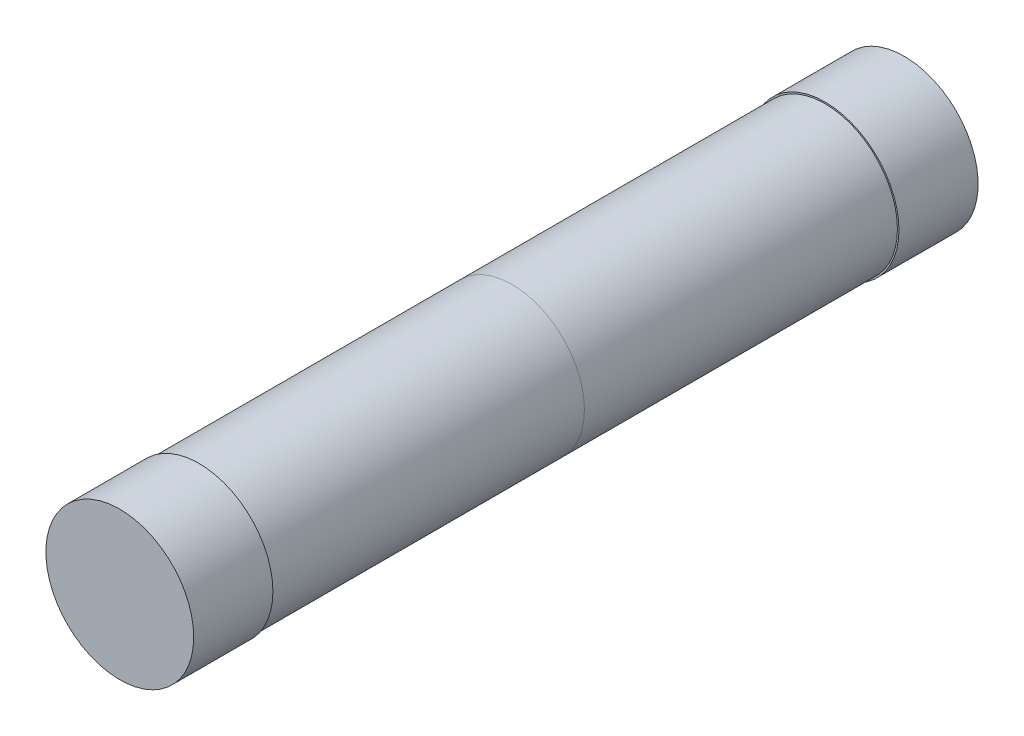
ISO-10303-21;
HEADER;
FILE_DESCRIPTION(('STEP AP214'),'2;1');
FILE_NAME('part.step','',(''),(''),'','','');
FILE_SCHEMA(('AUTOMOTIVE_DESIGN { 1 0 10303 214 1 1 1 1 }'));
ENDSEC;
DATA;
#1=APPLICATION_CONTEXT('core data for automotive mechanical design processes');
#2=APPLICATION_PROTOCOL_DEFINITION('international standard','automotive_design',2000,#1);
#3=PRODUCT_CONTEXT('',#1,'mechanical');
#4=PRODUCT('Part','Part','',(#3));
#5=PRODUCT_RELATED_PRODUCT_CATEGORY('part','',(#4));
#6=PRODUCT_DEFINITION_FORMATION('','',#4);
#7=PRODUCT_DEFINITION_CONTEXT('part definition',#1,'design');
#8=PRODUCT_DEFINITION('design','',#6,#7);
#9=PRODUCT_DEFINITION_SHAPE('','',#8);
#10=(LENGTH_UNIT() NAMED_UNIT(*) SI_UNIT(.MILLI.,.METRE.));
#11=(NAMED_UNIT(*) PLANE_ANGLE_UNIT() SI_UNIT($,.RADIAN.));
#12=(NAMED_UNIT(*) SI_UNIT($,.STERADIAN.) SOLID_ANGLE_UNIT());
#13=UNCERTAINTY_MEASURE_WITH_UNIT(LENGTH_MEASURE(1.E-05),#10,'distance_accuracy_value','');
#14=(GEOMETRIC_REPRESENTATION_CONTEXT(3) GLOBAL_UNCERTAINTY_ASSIGNED_CONTEXT((#13)) GLOBAL_UNIT_ASSIGNED_CONTEXT((#10,
#11,#12)) REPRESENTATION_CONTEXT('',''));
#15=CARTESIAN_POINT('',(0.,0.,0.));
#16=DIRECTION('',(0.,0.,1.));
#17=DIRECTION('',(1.,0.,0.));
#18=AXIS2_PLACEMENT_3D('',#15,#16,#17);
#19=CARTESIAN_POINT('',(9.69843126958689,-11.236668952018,-2.81415839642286));
#20=DIRECTION('',(0.,0.,1.));
#21=DIRECTION('',(1.,0.,0.));
#22=AXIS2_PLACEMENT_3D('',#19,#20,#21);
#23=CYLINDRICAL_SURFACE('',#22,0.960000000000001);
#24=CARTESIAN_POINT('',(9.69843126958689,-11.236668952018,5.48584160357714));
#25=DIRECTION('',(0.,0.,1.));
#26=DIRECTION('',(1.,0.,0.));
#27=AXIS2_PLACEMENT_3D('',#24,#25,#26);
#28=CIRCLE('',#27,0.960000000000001);
#29=CARTESIAN_POINT('',(10.6584312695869,-11.236668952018,5.48584160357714));
#30=VERTEX_POINT('',#29);
#31=EDGE_CURVE('E57',#30,#30,#28,.T.);
#32=CARTESIAN_POINT('',(9.69843126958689,-11.236668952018,1.33584160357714));
#33=DIRECTION('',(0.,0.,-1.));
#34=DIRECTION('',(-1.,0.,0.));
#35=AXIS2_PLACEMENT_3D('',#32,#33,#34);
#36=CIRCLE('',#35,0.960000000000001);
#37=CARTESIAN_POINT('',(10.6584312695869,-11.236668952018,1.33584160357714));
#38=VERTEX_POINT('',#37);
#39=EDGE_CURVE('E11',#38,#38,#36,.F.);
#40=CARTESIAN_POINT('',(10.6584312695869,-11.236668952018,5.48584160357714));
#41=CARTESIAN_POINT('',(10.6584312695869,-11.236668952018,5.44261243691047));
#42=CARTESIAN_POINT('',(10.6584312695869,-11.236668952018,5.3993832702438));
#43=CARTESIAN_POINT('',(10.6584312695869,-11.236668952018,5.31292493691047));
#44=CARTESIAN_POINT('',(10.6584312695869,-11.236668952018,5.26969577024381));
#45=CARTESIAN_POINT('',(10.6584312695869,-11.236668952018,5.18323743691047));
#46=CARTESIAN_POINT('',(10.6584312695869,-11.236668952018,5.1400082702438));
#47=CARTESIAN_POINT('',(10.6584312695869,-11.236668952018,5.05354993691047));
#48=CARTESIAN_POINT('',(10.6584312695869,-11.236668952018,5.0103207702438));
#49=CARTESIAN_POINT('',(10.6584312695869,-11.236668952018,4.92386243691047));
#50=CARTESIAN_POINT('',(10.6584312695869,-11.236668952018,4.88063327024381));
#51=CARTESIAN_POINT('',(10.6584312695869,-11.236668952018,4.79417493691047));
#52=CARTESIAN_POINT('',(10.6584312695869,-11.236668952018,4.75094577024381));
#53=CARTESIAN_POINT('',(10.6584312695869,-11.236668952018,4.66448743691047));
#54=CARTESIAN_POINT('',(10.6584312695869,-11.236668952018,4.62125827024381));
#55=CARTESIAN_POINT('',(10.6584312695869,-11.236668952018,4.53479993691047));
#56=CARTESIAN_POINT('',(10.6584312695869,-11.236668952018,4.49157077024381));
#57=CARTESIAN_POINT('',(10.6584312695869,-11.236668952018,4.40511243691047));
#58=CARTESIAN_POINT('',(10.6584312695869,-11.236668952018,4.3618832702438));
#59=CARTESIAN_POINT('',(10.6584312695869,-11.236668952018,4.27542493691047));
#60=CARTESIAN_POINT('',(10.6584312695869,-11.236668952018,4.23219577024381));
#61=CARTESIAN_POINT('',(10.6584312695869,-11.236668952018,4.14573743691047));
#62=CARTESIAN_POINT('',(10.6584312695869,-11.236668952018,4.10250827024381));
#63=CARTESIAN_POINT('',(10.6584312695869,-11.236668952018,4.01604993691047));
#64=CARTESIAN_POINT('',(10.6584312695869,-11.236668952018,3.9728207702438));
#65=CARTESIAN_POINT('',(10.6584312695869,-11.236668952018,3.88636243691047));
#66=CARTESIAN_POINT('',(10.6584312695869,-11.236668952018,3.84313327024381));
#67=CARTESIAN_POINT('',(10.6584312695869,-11.236668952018,3.75667493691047));
#68=CARTESIAN_POINT('',(10.6584312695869,-11.236668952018,3.7134457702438));
#69=CARTESIAN_POINT('',(10.6584312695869,-11.236668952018,3.62698743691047));
#70=CARTESIAN_POINT('',(10.6584312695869,-11.236668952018,3.5837582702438));
#71=CARTESIAN_POINT('',(10.6584312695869,-11.236668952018,3.49729993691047));
#72=CARTESIAN_POINT('',(10.6584312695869,-11.236668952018,3.4540707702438));
#73=CARTESIAN_POINT('',(10.6584312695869,-11.236668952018,3.36761243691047));
#74=CARTESIAN_POINT('',(10.6584312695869,-11.236668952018,3.32438327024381));
#75=CARTESIAN_POINT('',(10.6584312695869,-11.236668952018,3.23792493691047));
#76=CARTESIAN_POINT('',(10.6584312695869,-11.236668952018,3.19469577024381));
#77=CARTESIAN_POINT('',(10.6584312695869,-11.236668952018,3.10823743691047));
#78=CARTESIAN_POINT('',(10.6584312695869,-11.236668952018,3.0650082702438));
#79=CARTESIAN_POINT('',(10.6584312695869,-11.236668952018,2.97854993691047));
#80=CARTESIAN_POINT('',(10.6584312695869,-11.236668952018,2.9353207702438));
#81=CARTESIAN_POINT('',(10.6584312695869,-11.236668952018,2.84886243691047));
#82=CARTESIAN_POINT('',(10.6584312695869,-11.236668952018,2.80563327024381));
#83=CARTESIAN_POINT('',(10.6584312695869,-11.236668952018,2.71917493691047));
#84=CARTESIAN_POINT('',(10.6584312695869,-11.236668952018,2.6759457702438));
#85=CARTESIAN_POINT('',(10.6584312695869,-11.236668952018,2.58948743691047));
#86=CARTESIAN_POINT('',(10.6584312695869,-11.236668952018,2.5462582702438));
#87=CARTESIAN_POINT('',(10.6584312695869,-11.236668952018,2.45979993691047));
#88=CARTESIAN_POINT('',(10.6584312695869,-11.236668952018,2.4165707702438));
#89=CARTESIAN_POINT('',(10.6584312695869,-11.236668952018,2.33011243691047));
#90=CARTESIAN_POINT('',(10.6584312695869,-11.236668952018,2.28688327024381));
#91=CARTESIAN_POINT('',(10.6584312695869,-11.236668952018,2.20042493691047));
#92=CARTESIAN_POINT('',(10.6584312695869,-11.236668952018,2.1571957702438));
#93=CARTESIAN_POINT('',(10.6584312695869,-11.236668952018,2.07073743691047));
#94=CARTESIAN_POINT('',(10.6584312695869,-11.236668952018,2.0275082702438));
#95=CARTESIAN_POINT('',(10.6584312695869,-11.236668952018,1.94104993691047));
#96=CARTESIAN_POINT('',(10.6584312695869,-11.236668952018,1.8978207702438));
#97=CARTESIAN_POINT('',(10.6584312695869,-11.236668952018,1.81136243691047));
#98=CARTESIAN_POINT('',(10.6584312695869,-11.236668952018,1.7681332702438));
#99=CARTESIAN_POINT('',(10.6584312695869,-11.236668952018,1.68167493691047));
#100=CARTESIAN_POINT('',(10.6584312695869,-11.236668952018,1.6384457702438));
#101=CARTESIAN_POINT('',(10.6584312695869,-11.236668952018,1.55198743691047));
#102=CARTESIAN_POINT('',(10.6584312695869,-11.236668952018,1.5087582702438));
#103=CARTESIAN_POINT('',(10.6584312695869,-11.236668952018,1.42229993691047));
#104=CARTESIAN_POINT('',(10.6584312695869,-11.236668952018,1.3790707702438));
#105=CARTESIAN_POINT('',(10.6584312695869,-11.236668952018,1.33584160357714));
#106=B_SPLINE_CURVE_WITH_KNOTS('',3,(#40,#41,#42,#43,#44,#45,#46,#47,#48,#49,#50,#51,#52,#53,
#54,#55,#56,#57,#58,#59,#60,#61,#62,#63,#64,#65,#66,#67,#68,#69,#70,#71,#72,#73,#74,#75,#76,#77,
#78,#79,#80,#81,#82,#83,#84,#85,#86,#87,#88,#89,#90,#91,#92,#93,#94,#95,#96,#97,#98,#99,#100,
#101,#102,#103,#104,#105),.UNSPECIFIED.,.F.,.F.,(4,2,2,2,2,2,2,2,2,2,2,2,2,2,2,2,2,2,2,2,2,2,2,
2,2,2,2,2,2,2,2,2,4),(0.,0.1296875,0.259374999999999,0.389062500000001,0.518749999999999,
0.648437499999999,0.778124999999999,0.9078125,1.0375,1.1671875,1.296875,1.4265625,1.55625,
1.6859375,1.815625,1.9453125,2.075,2.2046875,2.334375,2.4640625,2.59375,2.7234375,2.853125,
2.9828125,3.1125,3.2421875,3.371875,3.5015625,3.63125,3.7609375,3.890625,4.0203125,4.15),.UNSPECIFIED.);
#107=EDGE_CURVE('BSEAM35',#30,#38,#106,.T.);
#108=ORIENTED_EDGE('',*,*,#31,.F.);
#109=ORIENTED_EDGE('',*,*,#39,.T.);
#110=ORIENTED_EDGE('',*,*,#107,.T.);
#111=ORIENTED_EDGE('',*,*,#107,.F.);
#112=EDGE_LOOP('',(#108,#110,#109,#111));
#113=FACE_BOUND('',#112,.T.);
#114=ADVANCED_FACE('F35',(#113),#23,.T.);
#115=CARTESIAN_POINT('',(10.7274311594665,-10.207669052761,-3.86415839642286));
#116=DIRECTION('',(0.,0.,-1.));
#117=DIRECTION('',(0.,-1.,0.));
#118=AXIS2_PLACEMENT_3D('',#115,#116,#117);
#119=PLANE('',#118);
#120=CARTESIAN_POINT('',(9.69843126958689,-11.236668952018,-3.86415839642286));
#121=DIRECTION('',(0.,0.,-1.));
#122=DIRECTION('',(-1.,0.,0.));
#123=AXIS2_PLACEMENT_3D('',#120,#121,#122);
#124=CIRCLE('',#123,0.979999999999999);
#125=CARTESIAN_POINT('',(8.71843126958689,-11.236668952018,-3.86415839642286));
#126=VERTEX_POINT('',#125);
#127=EDGE_CURVE('E43',#126,#126,#124,.F.);
#128=ORIENTED_EDGE('',*,*,#127,.F.);
#129=EDGE_LOOP('',(#128));
#130=FACE_BOUND('',#129,.T.);
#131=ADVANCED_FACE('F86',(#130),#119,.T.);
#132=CARTESIAN_POINT('',(9.69843126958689,-11.236668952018,-1.66415839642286));
#133=DIRECTION('',(0.,0.,-1.));
#134=DIRECTION('',(-1.,0.,0.));
#135=AXIS2_PLACEMENT_3D('',#132,#133,#134);
#136=CYLINDRICAL_SURFACE('',#135,0.979999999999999);
#137=ORIENTED_EDGE('',*,*,#127,.T.);
#138=EDGE_LOOP('',(#137));
#139=FACE_BOUND('',#138,.T.);
#140=CARTESIAN_POINT('',(9.69843126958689,-11.236668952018,-2.81415839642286));
#141=DIRECTION('',(0.,0.,1.));
#142=DIRECTION('',(1.,0.,0.));
#143=AXIS2_PLACEMENT_3D('',#140,#141,#142);
#144=CIRCLE('',#143,0.979999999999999);
#145=CARTESIAN_POINT('',(10.6784312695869,-11.236668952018,-2.81415839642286));
#146=VERTEX_POINT('',#145);
#147=EDGE_CURVE('E60',#146,#146,#144,.F.);
#148=ORIENTED_EDGE('',*,*,#147,.T.);
#149=EDGE_LOOP('',(#148));
#150=FACE_BOUND('',#149,.T.);
#151=ADVANCED_FACE('F37',(#139,#150),#136,.T.);
#152=CARTESIAN_POINT('',(9.69843126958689,-11.236668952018,-2.81415839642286));
#153=DIRECTION('',(0.,0.,1.));
#154=DIRECTION('',(1.,0.,0.));
#155=AXIS2_PLACEMENT_3D('',#152,#153,#154);
#156=PLANE('',#155);
#157=ORIENTED_EDGE('',*,*,#147,.F.);
#158=EDGE_LOOP('',(#157));
#159=FACE_BOUND('',#158,.T.);
#160=CARTESIAN_POINT('',(9.69843126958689,-11.236668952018,-2.81415839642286));
#161=DIRECTION('',(0.,0.,1.));
#162=DIRECTION('',(1.,0.,0.));
#163=AXIS2_PLACEMENT_3D('',#160,#161,#162);
#164=CIRCLE('',#163,0.960000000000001);
#165=CARTESIAN_POINT('',(10.6584312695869,-11.236668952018,-2.81415839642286));
#166=VERTEX_POINT('',#165);
#167=EDGE_CURVE('E62',#166,#166,#164,.T.);
#168=ORIENTED_EDGE('',*,*,#167,.F.);
#169=EDGE_LOOP('',(#168));
#170=FACE_BOUND('',#169,.T.);
#171=ADVANCED_FACE('F94',(#159,#170),#156,.T.);
#172=CARTESIAN_POINT('',(9.69843126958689,-11.236668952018,5.48584160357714));
#173=DIRECTION('',(0.,0.,1.));
#174=DIRECTION('',(1.,0.,0.));
#175=AXIS2_PLACEMENT_3D('',#172,#173,#174);
#176=PLANE('',#175);
#177=CARTESIAN_POINT('',(9.69843126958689,-11.236668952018,5.48584160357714));
#178=DIRECTION('',(0.,0.,1.));
#179=DIRECTION('',(1.,0.,0.));
#180=AXIS2_PLACEMENT_3D('',#177,#178,#179);
#181=CIRCLE('',#180,0.98);
#182=CARTESIAN_POINT('',(10.6784312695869,-11.236668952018,5.48584160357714));
#183=VERTEX_POINT('',#182);
#184=EDGE_CURVE('E54',#183,#183,#181,.F.);
#185=ORIENTED_EDGE('',*,*,#184,.T.);
#186=EDGE_LOOP('',(#185));
#187=FACE_BOUND('',#186,.T.);
#188=ORIENTED_EDGE('',*,*,#31,.T.);
#189=EDGE_LOOP('',(#188));
#190=FACE_BOUND('',#189,.T.);
#191=ADVANCED_FACE('F66',(#187,#190),#176,.F.);
#192=CARTESIAN_POINT('',(10.6584312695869,-11.236668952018,1.33584160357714));
#193=CARTESIAN_POINT('',(10.6584312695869,-11.236668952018,1.29261243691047));
#194=CARTESIAN_POINT('',(10.6584312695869,-11.236668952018,1.2493832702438));
#195=CARTESIAN_POINT('',(10.6584312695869,-11.236668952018,1.16292493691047));
#196=CARTESIAN_POINT('',(10.6584312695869,-11.236668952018,1.1196957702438));
#197=CARTESIAN_POINT('',(10.6584312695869,-11.236668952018,1.03323743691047));
#198=CARTESIAN_POINT('',(10.6584312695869,-11.236668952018,0.990008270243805));
#199=CARTESIAN_POINT('',(10.6584312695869,-11.236668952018,0.903549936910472));
#200=CARTESIAN_POINT('',(10.6584312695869,-11.236668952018,0.860320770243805));
#201=CARTESIAN_POINT('',(10.6584312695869,-11.236668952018,0.773862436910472));
#202=CARTESIAN_POINT('',(10.6584312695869,-11.236668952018,0.730633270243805));
#203=CARTESIAN_POINT('',(10.6584312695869,-11.236668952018,0.644174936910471));
#204=CARTESIAN_POINT('',(10.6584312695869,-11.236668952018,0.600945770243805));
#205=CARTESIAN_POINT('',(10.6584312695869,-11.236668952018,0.514487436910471));
#206=CARTESIAN_POINT('',(10.6584312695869,-11.236668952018,0.471258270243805));
#207=CARTESIAN_POINT('',(10.6584312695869,-11.236668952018,0.384799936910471));
#208=CARTESIAN_POINT('',(10.6584312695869,-11.236668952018,0.341570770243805));
#209=CARTESIAN_POINT('',(10.6584312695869,-11.236668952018,0.255112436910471));
#210=CARTESIAN_POINT('',(10.6584312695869,-11.236668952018,0.211883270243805));
#211=CARTESIAN_POINT('',(10.6584312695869,-11.236668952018,0.125424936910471));
#212=CARTESIAN_POINT('',(10.6584312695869,-11.236668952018,0.0821957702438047));
#213=CARTESIAN_POINT('',(10.6584312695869,-11.236668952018,-0.00426256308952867));
#214=CARTESIAN_POINT('',(10.6584312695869,-11.236668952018,-0.0474917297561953));
#215=CARTESIAN_POINT('',(10.6584312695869,-11.236668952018,-0.133950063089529));
#216=CARTESIAN_POINT('',(10.6584312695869,-11.236668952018,-0.177179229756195));
#217=CARTESIAN_POINT('',(10.6584312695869,-11.236668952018,-0.263637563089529));
#218=CARTESIAN_POINT('',(10.6584312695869,-11.236668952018,-0.306866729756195));
#219=CARTESIAN_POINT('',(10.6584312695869,-11.236668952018,-0.393325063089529));
#220=CARTESIAN_POINT('',(10.6584312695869,-11.236668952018,-0.436554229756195));
#221=CARTESIAN_POINT('',(10.6584312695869,-11.236668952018,-0.523012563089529));
#222=CARTESIAN_POINT('',(10.6584312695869,-11.236668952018,-0.566241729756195));
#223=CARTESIAN_POINT('',(10.6584312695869,-11.236668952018,-0.652700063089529));
#224=CARTESIAN_POINT('',(10.6584312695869,-11.236668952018,-0.695929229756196));
#225=CARTESIAN_POINT('',(10.6584312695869,-11.236668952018,-0.782387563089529));
#226=CARTESIAN_POINT('',(10.6584312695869,-11.236668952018,-0.825616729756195));
#227=CARTESIAN_POINT('',(10.6584312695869,-11.236668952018,-0.912075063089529));
#228=CARTESIAN_POINT('',(10.6584312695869,-11.236668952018,-0.955304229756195));
#229=CARTESIAN_POINT('',(10.6584312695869,-11.236668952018,-1.04176256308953));
#230=CARTESIAN_POINT('',(10.6584312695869,-11.236668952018,-1.0849917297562));
#231=CARTESIAN_POINT('',(10.6584312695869,-11.236668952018,-1.17145006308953));
#232=CARTESIAN_POINT('',(10.6584312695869,-11.236668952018,-1.2146792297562));
#233=CARTESIAN_POINT('',(10.6584312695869,-11.236668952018,-1.30113756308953));
#234=CARTESIAN_POINT('',(10.6584312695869,-11.236668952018,-1.3443667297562));
#235=CARTESIAN_POINT('',(10.6584312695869,-11.236668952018,-1.43082506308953));
#236=CARTESIAN_POINT('',(10.6584312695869,-11.236668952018,-1.4740542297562));
#237=CARTESIAN_POINT('',(10.6584312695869,-11.236668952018,-1.56051256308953));
#238=CARTESIAN_POINT('',(10.6584312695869,-11.236668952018,-1.6037417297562));
#239=CARTESIAN_POINT('',(10.6584312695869,-11.236668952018,-1.69020006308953));
#240=CARTESIAN_POINT('',(10.6584312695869,-11.236668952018,-1.7334292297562));
#241=CARTESIAN_POINT('',(10.6584312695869,-11.236668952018,-1.81988756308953));
#242=CARTESIAN_POINT('',(10.6584312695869,-11.236668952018,-1.8631167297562));
#243=CARTESIAN_POINT('',(10.6584312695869,-11.236668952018,-1.94957506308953));
#244=CARTESIAN_POINT('',(10.6584312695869,-11.236668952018,-1.9928042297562));
#245=CARTESIAN_POINT('',(10.6584312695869,-11.236668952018,-2.07926256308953));
#246=CARTESIAN_POINT('',(10.6584312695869,-11.236668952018,-2.1224917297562));
#247=CARTESIAN_POINT('',(10.6584312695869,-11.236668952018,-2.20895006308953));
#248=CARTESIAN_POINT('',(10.6584312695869,-11.236668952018,-2.2521792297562));
#249=CARTESIAN_POINT('',(10.6584312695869,-11.236668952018,-2.33863756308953));
#250=CARTESIAN_POINT('',(10.6584312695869,-11.236668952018,-2.3818667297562));
#251=CARTESIAN_POINT('',(10.6584312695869,-11.236668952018,-2.46832506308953));
#252=CARTESIAN_POINT('',(10.6584312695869,-11.236668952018,-2.5115542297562));
#253=CARTESIAN_POINT('',(10.6584312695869,-11.236668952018,-2.59801256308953));
#254=CARTESIAN_POINT('',(10.6584312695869,-11.236668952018,-2.6412417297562));
#255=CARTESIAN_POINT('',(10.6584312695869,-11.236668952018,-2.72770006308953));
#256=CARTESIAN_POINT('',(10.6584312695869,-11.236668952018,-2.7709292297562));
#257=CARTESIAN_POINT('',(10.6584312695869,-11.236668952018,-2.81415839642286));
#258=B_SPLINE_CURVE_WITH_KNOTS('',3,(#192,#193,#194,#195,#196,#197,#198,#199,#200,#201,#202,
#203,#204,#205,#206,#207,#208,#209,#210,#211,#212,#213,#214,#215,#216,#217,#218,#219,#220,#221,
#222,#223,#224,#225,#226,#227,#228,#229,#230,#231,#232,#233,#234,#235,#236,#237,#238,#239,#240,
#241,#242,#243,#244,#245,#246,#247,#248,#249,#250,#251,#252,#253,#254,#255,#256,#257),
.UNSPECIFIED.,.F.,.F.,(4,2,2,2,2,2,2,2,2,2,2,2,2,2,2,2,2,2,2,2,2,2,2,2,2,2,2,2,2,2,2,2,4),(0.,
0.1296875,0.259375,0.3890625,0.51875,0.6484375,0.778125,0.9078125,1.0375,1.1671875,1.296875,
1.4265625,1.55625,1.6859375,1.815625,1.9453125,2.075,2.2046875,2.334375,2.4640625,2.59375,
2.7234375,2.853125,2.9828125,3.1125,3.2421875,3.371875,3.5015625,3.63125,3.7609375,3.890625,
4.0203125,4.15),.UNSPECIFIED.);
#259=EDGE_CURVE('BSEAM73',#38,#166,#258,.T.);
#260=ORIENTED_EDGE('',*,*,#39,.F.);
#261=ORIENTED_EDGE('',*,*,#167,.T.);
#262=ORIENTED_EDGE('',*,*,#259,.T.);
#263=ORIENTED_EDGE('',*,*,#259,.F.);
#264=EDGE_LOOP('',(#260,#262,#261,#263));
#265=FACE_BOUND('',#264,.T.);
#266=ADVANCED_FACE('F73',(#265),#23,.T.);
#267=CARTESIAN_POINT('',(10.7274311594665,-10.207669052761,6.53584160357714));
#268=DIRECTION('',(0.,0.,1.));
#269=DIRECTION('',(-1.,0.,0.));
#270=AXIS2_PLACEMENT_3D('',#267,#268,#269);
#271=PLANE('',#270);
#272=CARTESIAN_POINT('',(9.69843126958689,-11.236668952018,6.53584160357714));
#273=DIRECTION('',(0.,0.,1.));
#274=DIRECTION('',(1.,0.,0.));
#275=AXIS2_PLACEMENT_3D('',#272,#273,#274);
#276=CIRCLE('',#275,0.98);
#277=CARTESIAN_POINT('',(10.6784312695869,-11.236668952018,6.53584160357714));
#278=VERTEX_POINT('',#277);
#279=EDGE_CURVE('E49',#278,#278,#276,.F.);
#280=ORIENTED_EDGE('',*,*,#279,.F.);
#281=EDGE_LOOP('',(#280));
#282=FACE_BOUND('',#281,.T.);
#283=ADVANCED_FACE('F72',(#282),#271,.T.);
#284=CARTESIAN_POINT('',(9.69843126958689,-11.236668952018,4.33584160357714));
#285=DIRECTION('',(0.,0.,1.));
#286=DIRECTION('',(1.,0.,0.));
#287=AXIS2_PLACEMENT_3D('',#284,#285,#286);
#288=CYLINDRICAL_SURFACE('',#287,0.98);
#289=ORIENTED_EDGE('',*,*,#184,.F.);
#290=EDGE_LOOP('',(#289));
#291=FACE_BOUND('',#290,.T.);
#292=ORIENTED_EDGE('',*,*,#279,.T.);
#293=EDGE_LOOP('',(#292));
#294=FACE_BOUND('',#293,.T.);
#295=ADVANCED_FACE('F69',(#291,#294),#288,.T.);
#296=CLOSED_SHELL('',(#114,#131,#151,#171,#191,#266,#283,#295));
#297=MANIFOLD_SOLID_BREP('B2',#296);
#298=ADVANCED_BREP_SHAPE_REPRESENTATION('',(#18,#297),#14);
#299=SHAPE_DEFINITION_REPRESENTATION(#9,#298);
ENDSEC;
END-ISO-10303-21;
